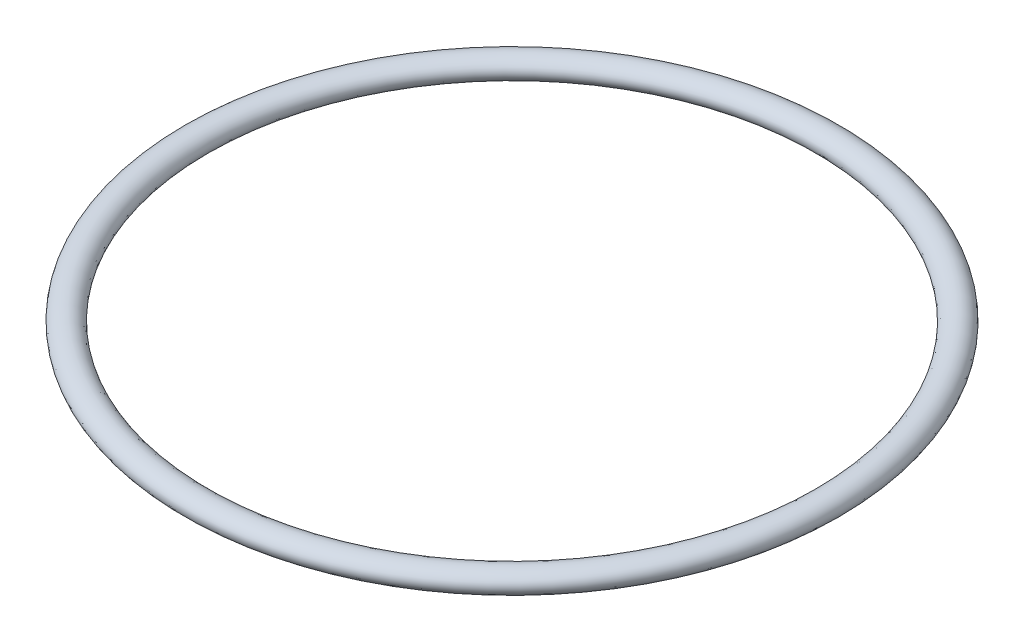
from build123d import *

# Parameters (mm, degrees)
ESQUISSE1_RX = 1
ESQUISSE1_RY = 0.75


with BuildPart() as part:
    # Esquisse1 → R_volution1 (revolve)
    with BuildSketch(Plane.XY):
        with Locations(Location((22, 0.75), (0, 0, 180))):
            Ellipse(ESQUISSE1_RX, ESQUISSE1_RY)
    revolve(axis=Axis((0, 0, 0), (0, 1, 0)))


solid = part.part
